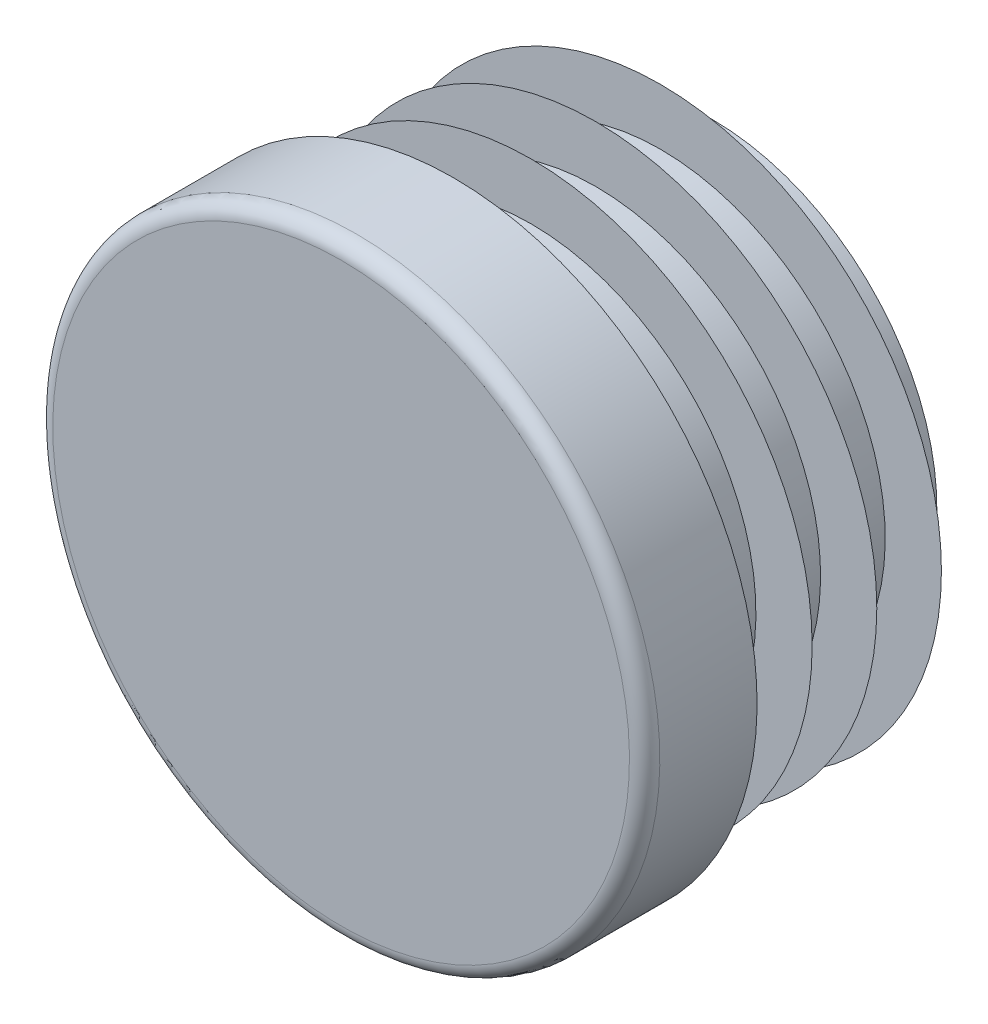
ISO-10303-21;
HEADER;
FILE_DESCRIPTION(('STEP AP214'),'2;1');
FILE_NAME('part.step','',(''),(''),'','','');
FILE_SCHEMA(('AUTOMOTIVE_DESIGN { 1 0 10303 214 1 1 1 1 }'));
ENDSEC;
DATA;
#1=APPLICATION_CONTEXT('core data for automotive mechanical design processes');
#2=APPLICATION_PROTOCOL_DEFINITION('international standard','automotive_design',2000,#1);
#3=PRODUCT_CONTEXT('',#1,'mechanical');
#4=PRODUCT('Part','Part','',(#3));
#5=PRODUCT_RELATED_PRODUCT_CATEGORY('part','',(#4));
#6=PRODUCT_DEFINITION_FORMATION('','',#4);
#7=PRODUCT_DEFINITION_CONTEXT('part definition',#1,'design');
#8=PRODUCT_DEFINITION('design','',#6,#7);
#9=PRODUCT_DEFINITION_SHAPE('','',#8);
#10=(LENGTH_UNIT() NAMED_UNIT(*) SI_UNIT(.MILLI.,.METRE.));
#11=(NAMED_UNIT(*) PLANE_ANGLE_UNIT() SI_UNIT($,.RADIAN.));
#12=(NAMED_UNIT(*) SI_UNIT($,.STERADIAN.) SOLID_ANGLE_UNIT());
#13=UNCERTAINTY_MEASURE_WITH_UNIT(LENGTH_MEASURE(1.E-05),#10,'distance_accuracy_value','');
#14=(GEOMETRIC_REPRESENTATION_CONTEXT(3) GLOBAL_UNCERTAINTY_ASSIGNED_CONTEXT((#13)) GLOBAL_UNIT_ASSIGNED_CONTEXT((#10,
#11,#12)) REPRESENTATION_CONTEXT('',''));
#15=CARTESIAN_POINT('',(0.,0.,0.));
#16=DIRECTION('',(0.,0.,1.));
#17=DIRECTION('',(1.,0.,0.));
#18=AXIS2_PLACEMENT_3D('',#15,#16,#17);
#19=CARTESIAN_POINT('',(0.,0.,5.));
#20=DIRECTION('',(0.,0.,-1.));
#21=DIRECTION('',(0.,1.,0.));
#22=AXIS2_PLACEMENT_3D('',#19,#20,#21);
#23=PLANE('',#22);
#24=CARTESIAN_POINT('',(0.,0.,5.));
#25=DIRECTION('',(0.,0.,-1.));
#26=DIRECTION('',(0.,1.,0.));
#27=AXIS2_PLACEMENT_3D('',#24,#25,#26);
#28=CIRCLE('',#27,12.825);
#29=CARTESIAN_POINT('',(0.,12.825,5.));
#30=VERTEX_POINT('',#29);
#31=EDGE_CURVE('E8',#30,#30,#28,.T.);
#32=ORIENTED_EDGE('',*,*,#31,.F.);
#33=EDGE_LOOP('',(#32));
#34=FACE_BOUND('',#33,.T.);
#35=ADVANCED_FACE('F12',(#34),#23,.F.);
#36=CARTESIAN_POINT('',(0.,0.,4.325));
#37=DIRECTION('',(0.,0.,-1.));
#38=DIRECTION('',(0.,1.,0.));
#39=AXIS2_PLACEMENT_3D('',#36,#37,#38);
#40=TOROIDAL_SURFACE('',#39,12.825,0.675);
#41=ORIENTED_EDGE('',*,*,#31,.T.);
#42=EDGE_LOOP('',(#41));
#43=FACE_BOUND('',#42,.T.);
#44=CARTESIAN_POINT('',(0.,0.,4.325));
#45=DIRECTION('',(0.,0.,-1.));
#46=DIRECTION('',(0.,1.,0.));
#47=AXIS2_PLACEMENT_3D('',#44,#45,#46);
#48=CIRCLE('',#47,13.5);
#49=CARTESIAN_POINT('',(0.,13.5,4.325));
#50=VERTEX_POINT('',#49);
#51=EDGE_CURVE('E18',#50,#50,#48,.T.);
#52=ORIENTED_EDGE('',*,*,#51,.F.);
#53=EDGE_LOOP('',(#52));
#54=FACE_BOUND('',#53,.T.);
#55=ADVANCED_FACE('F159',(#43,#54),#40,.T.);
#56=CARTESIAN_POINT('',(0.,0.,-11.5));
#57=DIRECTION('',(0.,0.,-1.));
#58=DIRECTION('',(0.,1.,0.));
#59=AXIS2_PLACEMENT_3D('',#56,#57,#58);
#60=CYLINDRICAL_SURFACE('',#59,13.5);
#61=CARTESIAN_POINT('',(0.,0.,0.));
#62=DIRECTION('',(0.,0.,-1.));
#63=DIRECTION('',(0.,1.,0.));
#64=AXIS2_PLACEMENT_3D('',#61,#62,#63);
#65=CIRCLE('',#64,13.5);
#66=CARTESIAN_POINT('',(0.,13.5,0.));
#67=VERTEX_POINT('',#66);
#68=EDGE_CURVE('E22',#67,#67,#65,.T.);
#69=ORIENTED_EDGE('',*,*,#68,.F.);
#70=EDGE_LOOP('',(#69));
#71=FACE_BOUND('',#70,.T.);
#72=ORIENTED_EDGE('',*,*,#51,.T.);
#73=EDGE_LOOP('',(#72));
#74=FACE_BOUND('',#73,.T.);
#75=ADVANCED_FACE('F154',(#71,#74),#60,.T.);
#76=CARTESIAN_POINT('',(13.5,0.,0.));
#77=DIRECTION('',(0.,0.,1.));
#78=DIRECTION('',(0.,-1.,0.));
#79=AXIS2_PLACEMENT_3D('',#76,#77,#78);
#80=PLANE('',#79);
#81=CARTESIAN_POINT('',(0.,0.,0.));
#82=DIRECTION('',(0.,0.,-1.));
#83=DIRECTION('',(0.,1.,0.));
#84=AXIS2_PLACEMENT_3D('',#81,#82,#83);
#85=CIRCLE('',#84,10.);
#86=CARTESIAN_POINT('',(0.,10.,0.));
#87=VERTEX_POINT('',#86);
#88=EDGE_CURVE('E26',#87,#87,#85,.T.);
#89=ORIENTED_EDGE('',*,*,#88,.F.);
#90=EDGE_LOOP('',(#89));
#91=FACE_BOUND('',#90,.T.);
#92=ORIENTED_EDGE('',*,*,#68,.T.);
#93=EDGE_LOOP('',(#92));
#94=FACE_BOUND('',#93,.T.);
#95=ADVANCED_FACE('F148',(#91,#94),#80,.F.);
#96=CARTESIAN_POINT('',(0.,0.,-11.5));
#97=DIRECTION('',(0.,0.,-1.));
#98=DIRECTION('',(0.,1.,0.));
#99=AXIS2_PLACEMENT_3D('',#96,#97,#98);
#100=CYLINDRICAL_SURFACE('',#99,10.);
#101=CARTESIAN_POINT('',(0.,0.,-0.575));
#102=DIRECTION('',(0.,0.,-1.));
#103=DIRECTION('',(0.,1.,0.));
#104=AXIS2_PLACEMENT_3D('',#101,#102,#103);
#105=CIRCLE('',#104,10.);
#106=CARTESIAN_POINT('',(0.,10.,-0.575));
#107=VERTEX_POINT('',#106);
#108=EDGE_CURVE('E31',#107,#107,#105,.T.);
#109=ORIENTED_EDGE('',*,*,#108,.F.);
#110=EDGE_LOOP('',(#109));
#111=FACE_BOUND('',#110,.T.);
#112=ORIENTED_EDGE('',*,*,#88,.T.);
#113=EDGE_LOOP('',(#112));
#114=FACE_BOUND('',#113,.T.);
#115=ADVANCED_FACE('F142',(#111,#114),#100,.T.);
#116=CARTESIAN_POINT('',(10.,0.,-0.575));
#117=DIRECTION('',(0.,0.,-1.));
#118=DIRECTION('',(0.,1.,0.));
#119=AXIS2_PLACEMENT_3D('',#116,#117,#118);
#120=PLANE('',#119);
#121=CARTESIAN_POINT('',(0.,0.,-0.575));
#122=DIRECTION('',(0.,0.,-1.));
#123=DIRECTION('',(0.,1.,0.));
#124=AXIS2_PLACEMENT_3D('',#121,#122,#123);
#125=CIRCLE('',#124,12.5);
#126=CARTESIAN_POINT('',(0.,12.5,-0.575));
#127=VERTEX_POINT('',#126);
#128=EDGE_CURVE('E34',#127,#127,#125,.T.);
#129=ORIENTED_EDGE('',*,*,#128,.F.);
#130=EDGE_LOOP('',(#129));
#131=FACE_BOUND('',#130,.T.);
#132=ORIENTED_EDGE('',*,*,#108,.T.);
#133=EDGE_LOOP('',(#132));
#134=FACE_BOUND('',#133,.T.);
#135=ADVANCED_FACE('F136',(#131,#134),#120,.F.);
#136=CARTESIAN_POINT('',(0.,0.,-0.575));
#137=DIRECTION('',(0.,0.,1.));
#138=DIRECTION('',(0.,-1.,0.));
#139=AXIS2_PLACEMENT_3D('',#136,#137,#138);
#140=CONICAL_SURFACE('',#139,12.5,0.959931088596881);
#141=CARTESIAN_POINT('',(0.,0.,-2.32551884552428));
#142=DIRECTION('',(0.,0.,-1.));
#143=DIRECTION('',(0.,1.,0.));
#144=AXIS2_PLACEMENT_3D('',#141,#142,#143);
#145=CIRCLE('',#144,10.);
#146=CARTESIAN_POINT('',(0.,10.,-2.32551884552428));
#147=VERTEX_POINT('',#146);
#148=EDGE_CURVE('E37',#147,#147,#145,.T.);
#149=ORIENTED_EDGE('',*,*,#148,.F.);
#150=EDGE_LOOP('',(#149));
#151=FACE_BOUND('',#150,.T.);
#152=ORIENTED_EDGE('',*,*,#128,.T.);
#153=EDGE_LOOP('',(#152));
#154=FACE_BOUND('',#153,.T.);
#155=ADVANCED_FACE('F130',(#151,#154),#140,.T.);
#156=CARTESIAN_POINT('',(0.,0.,-11.5));
#157=DIRECTION('',(0.,0.,-1.));
#158=DIRECTION('',(0.,1.,0.));
#159=AXIS2_PLACEMENT_3D('',#156,#157,#158);
#160=CYLINDRICAL_SURFACE('',#159,10.);
#161=CARTESIAN_POINT('',(0.,0.,-3.45));
#162=DIRECTION('',(0.,0.,-1.));
#163=DIRECTION('',(0.,1.,0.));
#164=AXIS2_PLACEMENT_3D('',#161,#162,#163);
#165=CIRCLE('',#164,10.);
#166=CARTESIAN_POINT('',(0.,10.,-3.45));
#167=VERTEX_POINT('',#166);
#168=EDGE_CURVE('E40',#167,#167,#165,.T.);
#169=ORIENTED_EDGE('',*,*,#168,.F.);
#170=EDGE_LOOP('',(#169));
#171=FACE_BOUND('',#170,.T.);
#172=ORIENTED_EDGE('',*,*,#148,.T.);
#173=EDGE_LOOP('',(#172));
#174=FACE_BOUND('',#173,.T.);
#175=ADVANCED_FACE('F124',(#171,#174),#160,.T.);
#176=CARTESIAN_POINT('',(10.,0.,-3.45));
#177=DIRECTION('',(0.,0.,-1.));
#178=DIRECTION('',(0.,1.,0.));
#179=AXIS2_PLACEMENT_3D('',#176,#177,#178);
#180=PLANE('',#179);
#181=CARTESIAN_POINT('',(0.,0.,-3.45));
#182=DIRECTION('',(0.,0.,-1.));
#183=DIRECTION('',(0.,1.,0.));
#184=AXIS2_PLACEMENT_3D('',#181,#182,#183);
#185=CIRCLE('',#184,12.5);
#186=CARTESIAN_POINT('',(0.,12.5,-3.45));
#187=VERTEX_POINT('',#186);
#188=EDGE_CURVE('E43',#187,#187,#185,.T.);
#189=ORIENTED_EDGE('',*,*,#188,.F.);
#190=EDGE_LOOP('',(#189));
#191=FACE_BOUND('',#190,.T.);
#192=ORIENTED_EDGE('',*,*,#168,.T.);
#193=EDGE_LOOP('',(#192));
#194=FACE_BOUND('',#193,.T.);
#195=ADVANCED_FACE('F118',(#191,#194),#180,.F.);
#196=CARTESIAN_POINT('',(0.,0.,-3.45));
#197=DIRECTION('',(0.,0.,1.));
#198=DIRECTION('',(0.,-1.,0.));
#199=AXIS2_PLACEMENT_3D('',#196,#197,#198);
#200=CONICAL_SURFACE('',#199,12.5,0.959931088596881);
#201=CARTESIAN_POINT('',(0.,0.,-5.20051884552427));
#202=DIRECTION('',(0.,0.,-1.));
#203=DIRECTION('',(0.,1.,0.));
#204=AXIS2_PLACEMENT_3D('',#201,#202,#203);
#205=CIRCLE('',#204,10.);
#206=CARTESIAN_POINT('',(0.,10.,-5.20051884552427));
#207=VERTEX_POINT('',#206);
#208=EDGE_CURVE('E46',#207,#207,#205,.T.);
#209=ORIENTED_EDGE('',*,*,#208,.F.);
#210=EDGE_LOOP('',(#209));
#211=FACE_BOUND('',#210,.T.);
#212=ORIENTED_EDGE('',*,*,#188,.T.);
#213=EDGE_LOOP('',(#212));
#214=FACE_BOUND('',#213,.T.);
#215=ADVANCED_FACE('F112',(#211,#214),#200,.T.);
#216=CARTESIAN_POINT('',(0.,0.,-11.5));
#217=DIRECTION('',(0.,0.,-1.));
#218=DIRECTION('',(0.,1.,0.));
#219=AXIS2_PLACEMENT_3D('',#216,#217,#218);
#220=CYLINDRICAL_SURFACE('',#219,10.);
#221=CARTESIAN_POINT('',(0.,0.,-6.325));
#222=DIRECTION('',(0.,0.,-1.));
#223=DIRECTION('',(0.,1.,0.));
#224=AXIS2_PLACEMENT_3D('',#221,#222,#223);
#225=CIRCLE('',#224,10.);
#226=CARTESIAN_POINT('',(0.,10.,-6.325));
#227=VERTEX_POINT('',#226);
#228=EDGE_CURVE('E49',#227,#227,#225,.T.);
#229=ORIENTED_EDGE('',*,*,#228,.F.);
#230=EDGE_LOOP('',(#229));
#231=FACE_BOUND('',#230,.T.);
#232=ORIENTED_EDGE('',*,*,#208,.T.);
#233=EDGE_LOOP('',(#232));
#234=FACE_BOUND('',#233,.T.);
#235=ADVANCED_FACE('F106',(#231,#234),#220,.T.);
#236=CARTESIAN_POINT('',(10.,0.,-6.325));
#237=DIRECTION('',(0.,0.,-1.));
#238=DIRECTION('',(0.,1.,0.));
#239=AXIS2_PLACEMENT_3D('',#236,#237,#238);
#240=PLANE('',#239);
#241=CARTESIAN_POINT('',(0.,0.,-6.325));
#242=DIRECTION('',(0.,0.,-1.));
#243=DIRECTION('',(0.,1.,0.));
#244=AXIS2_PLACEMENT_3D('',#241,#242,#243);
#245=CIRCLE('',#244,12.5);
#246=CARTESIAN_POINT('',(0.,12.5,-6.325));
#247=VERTEX_POINT('',#246);
#248=EDGE_CURVE('E52',#247,#247,#245,.T.);
#249=ORIENTED_EDGE('',*,*,#248,.F.);
#250=EDGE_LOOP('',(#249));
#251=FACE_BOUND('',#250,.T.);
#252=ORIENTED_EDGE('',*,*,#228,.T.);
#253=EDGE_LOOP('',(#252));
#254=FACE_BOUND('',#253,.T.);
#255=ADVANCED_FACE('F100',(#251,#254),#240,.F.);
#256=CARTESIAN_POINT('',(0.,0.,-6.325));
#257=DIRECTION('',(0.,0.,1.));
#258=DIRECTION('',(0.,-1.,0.));
#259=AXIS2_PLACEMENT_3D('',#256,#257,#258);
#260=CONICAL_SURFACE('',#259,12.5,0.959931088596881);
#261=CARTESIAN_POINT('',(0.,0.,-8.07551884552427));
#262=DIRECTION('',(0.,0.,-1.));
#263=DIRECTION('',(0.,1.,0.));
#264=AXIS2_PLACEMENT_3D('',#261,#262,#263);
#265=CIRCLE('',#264,10.);
#266=CARTESIAN_POINT('',(0.,10.,-8.07551884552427));
#267=VERTEX_POINT('',#266);
#268=EDGE_CURVE('E55',#267,#267,#265,.T.);
#269=ORIENTED_EDGE('',*,*,#268,.F.);
#270=EDGE_LOOP('',(#269));
#271=FACE_BOUND('',#270,.T.);
#272=ORIENTED_EDGE('',*,*,#248,.T.);
#273=EDGE_LOOP('',(#272));
#274=FACE_BOUND('',#273,.T.);
#275=ADVANCED_FACE('F94',(#271,#274),#260,.T.);
#276=CARTESIAN_POINT('',(0.,0.,-11.5));
#277=DIRECTION('',(0.,0.,-1.));
#278=DIRECTION('',(0.,1.,0.));
#279=AXIS2_PLACEMENT_3D('',#276,#277,#278);
#280=CYLINDRICAL_SURFACE('',#279,10.);
#281=CARTESIAN_POINT('',(0.,0.,-9.2));
#282=DIRECTION('',(0.,0.,-1.));
#283=DIRECTION('',(0.,1.,0.));
#284=AXIS2_PLACEMENT_3D('',#281,#282,#283);
#285=CIRCLE('',#284,10.);
#286=CARTESIAN_POINT('',(0.,10.,-9.2));
#287=VERTEX_POINT('',#286);
#288=EDGE_CURVE('E58',#287,#287,#285,.T.);
#289=ORIENTED_EDGE('',*,*,#288,.F.);
#290=EDGE_LOOP('',(#289));
#291=FACE_BOUND('',#290,.T.);
#292=ORIENTED_EDGE('',*,*,#268,.T.);
#293=EDGE_LOOP('',(#292));
#294=FACE_BOUND('',#293,.T.);
#295=ADVANCED_FACE('F88',(#291,#294),#280,.T.);
#296=CARTESIAN_POINT('',(10.,0.,-9.2));
#297=DIRECTION('',(0.,0.,-1.));
#298=DIRECTION('',(0.,1.,0.));
#299=AXIS2_PLACEMENT_3D('',#296,#297,#298);
#300=PLANE('',#299);
#301=CARTESIAN_POINT('',(0.,0.,-9.2));
#302=DIRECTION('',(0.,0.,-1.));
#303=DIRECTION('',(0.,1.,0.));
#304=AXIS2_PLACEMENT_3D('',#301,#302,#303);
#305=CIRCLE('',#304,12.5);
#306=CARTESIAN_POINT('',(0.,12.5,-9.2));
#307=VERTEX_POINT('',#306);
#308=EDGE_CURVE('E61',#307,#307,#305,.T.);
#309=ORIENTED_EDGE('',*,*,#308,.F.);
#310=EDGE_LOOP('',(#309));
#311=FACE_BOUND('',#310,.T.);
#312=ORIENTED_EDGE('',*,*,#288,.T.);
#313=EDGE_LOOP('',(#312));
#314=FACE_BOUND('',#313,.T.);
#315=ADVANCED_FACE('F82',(#311,#314),#300,.F.);
#316=CARTESIAN_POINT('',(0.,0.,-9.2));
#317=DIRECTION('',(0.,0.,1.));
#318=DIRECTION('',(0.,-1.,0.));
#319=AXIS2_PLACEMENT_3D('',#316,#317,#318);
#320=CONICAL_SURFACE('',#319,12.5,0.959931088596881);
#321=CARTESIAN_POINT('',(0.,0.,-10.9505188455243));
#322=DIRECTION('',(0.,0.,-1.));
#323=DIRECTION('',(0.,1.,0.));
#324=AXIS2_PLACEMENT_3D('',#321,#322,#323);
#325=CIRCLE('',#324,10.);
#326=CARTESIAN_POINT('',(0.,10.,-10.9505188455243));
#327=VERTEX_POINT('',#326);
#328=EDGE_CURVE('E64',#327,#327,#325,.T.);
#329=ORIENTED_EDGE('',*,*,#328,.F.);
#330=EDGE_LOOP('',(#329));
#331=FACE_BOUND('',#330,.T.);
#332=ORIENTED_EDGE('',*,*,#308,.T.);
#333=EDGE_LOOP('',(#332));
#334=FACE_BOUND('',#333,.T.);
#335=ADVANCED_FACE('F76',(#331,#334),#320,.T.);
#336=CARTESIAN_POINT('',(0.,0.,-11.5));
#337=DIRECTION('',(0.,0.,-1.));
#338=DIRECTION('',(0.,1.,0.));
#339=AXIS2_PLACEMENT_3D('',#336,#337,#338);
#340=CYLINDRICAL_SURFACE('',#339,10.);
#341=CARTESIAN_POINT('',(0.,0.,-11.5));
#342=DIRECTION('',(0.,0.,-1.));
#343=DIRECTION('',(0.,1.,0.));
#344=AXIS2_PLACEMENT_3D('',#341,#342,#343);
#345=CIRCLE('',#344,10.);
#346=CARTESIAN_POINT('',(0.,10.,-11.5));
#347=VERTEX_POINT('',#346);
#348=EDGE_CURVE('E67',#347,#347,#345,.T.);
#349=ORIENTED_EDGE('',*,*,#348,.F.);
#350=EDGE_LOOP('',(#349));
#351=FACE_BOUND('',#350,.T.);
#352=ORIENTED_EDGE('',*,*,#328,.T.);
#353=EDGE_LOOP('',(#352));
#354=FACE_BOUND('',#353,.T.);
#355=ADVANCED_FACE('F73',(#351,#354),#340,.T.);
#356=CARTESIAN_POINT('',(10.,0.,-11.5));
#357=DIRECTION('',(0.,0.,1.));
#358=DIRECTION('',(0.,-1.,0.));
#359=AXIS2_PLACEMENT_3D('',#356,#357,#358);
#360=PLANE('',#359);
#361=ORIENTED_EDGE('',*,*,#348,.T.);
#362=EDGE_LOOP('',(#361));
#363=FACE_BOUND('',#362,.T.);
#364=ADVANCED_FACE('F71',(#363),#360,.F.);
#365=CLOSED_SHELL('',(#35,#55,#75,#95,#115,#135,#155,#175,#195,#215,#235,#255,#275,#295,#315,
#335,#355,#364));
#366=MANIFOLD_SOLID_BREP('B1',#365);
#367=ADVANCED_BREP_SHAPE_REPRESENTATION('',(#18,#366),#14);
#368=SHAPE_DEFINITION_REPRESENTATION(#9,#367);
ENDSEC;
END-ISO-10303-21;
